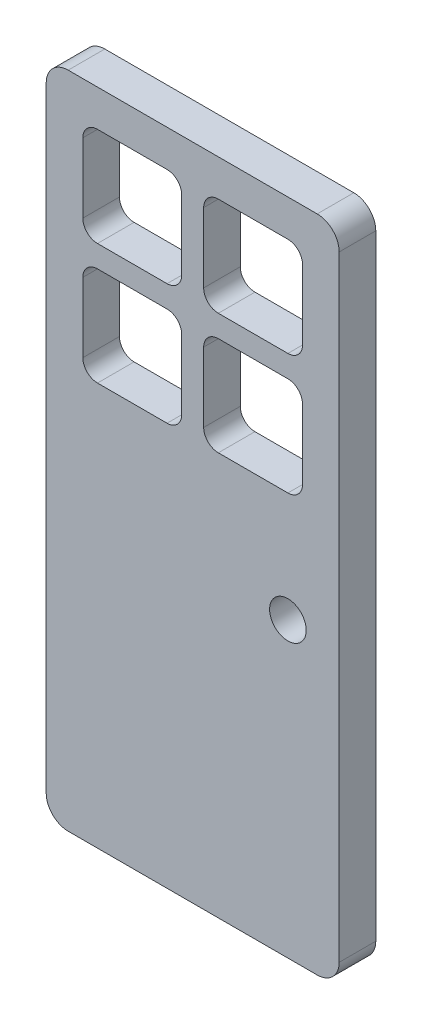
ISO-10303-21;
HEADER;
FILE_DESCRIPTION(('STEP AP214'),'2;1');
FILE_NAME('part.step','',(''),(''),'','','');
FILE_SCHEMA(('AUTOMOTIVE_DESIGN { 1 0 10303 214 1 1 1 1 }'));
ENDSEC;
DATA;
#1=APPLICATION_CONTEXT('core data for automotive mechanical design processes');
#2=APPLICATION_PROTOCOL_DEFINITION('international standard','automotive_design',2000,#1);
#3=PRODUCT_CONTEXT('',#1,'mechanical');
#4=PRODUCT('Part','Part','',(#3));
#5=PRODUCT_RELATED_PRODUCT_CATEGORY('part','',(#4));
#6=PRODUCT_DEFINITION_FORMATION('','',#4);
#7=PRODUCT_DEFINITION_CONTEXT('part definition',#1,'design');
#8=PRODUCT_DEFINITION('design','',#6,#7);
#9=PRODUCT_DEFINITION_SHAPE('','',#8);
#10=(LENGTH_UNIT() NAMED_UNIT(*) SI_UNIT(.MILLI.,.METRE.));
#11=(NAMED_UNIT(*) PLANE_ANGLE_UNIT() SI_UNIT($,.RADIAN.));
#12=(NAMED_UNIT(*) SI_UNIT($,.STERADIAN.) SOLID_ANGLE_UNIT());
#13=UNCERTAINTY_MEASURE_WITH_UNIT(LENGTH_MEASURE(1.E-05),#10,'distance_accuracy_value','');
#14=(GEOMETRIC_REPRESENTATION_CONTEXT(3) GLOBAL_UNCERTAINTY_ASSIGNED_CONTEXT((#13)) GLOBAL_UNIT_ASSIGNED_CONTEXT((#10,
#11,#12)) REPRESENTATION_CONTEXT('',''));
#15=CARTESIAN_POINT('',(0.,0.,0.));
#16=DIRECTION('',(0.,0.,1.));
#17=DIRECTION('',(1.,0.,0.));
#18=AXIS2_PLACEMENT_3D('',#15,#16,#17);
#19=CARTESIAN_POINT('',(-15.,9.99999999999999,-2.5));
#20=DIRECTION('',(-1.,0.,0.));
#21=DIRECTION('',(0.,-1.,0.));
#22=AXIS2_PLACEMENT_3D('',#19,#20,#21);
#23=PLANE('',#22);
#24=DIRECTION('',(0.,-1.,0.));
#25=VECTOR('',#24,1.);
#26=CARTESIAN_POINT('',(-15.,9.99999999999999,2.5));
#27=LINE('',#26,#25);
#28=CARTESIAN_POINT('',(-15.,21.5,2.5));
#29=VERTEX_POINT('',#28);
#30=CARTESIAN_POINT('',(-15.,12.,2.5));
#31=VERTEX_POINT('',#30);
#32=EDGE_CURVE('E510',#29,#31,#27,.T.);
#33=ORIENTED_EDGE('',*,*,#32,.T.);
#34=DIRECTION('',(0.,0.,1.));
#35=VECTOR('',#34,1.);
#36=CARTESIAN_POINT('',(-15.,12.,-2.5));
#37=LINE('',#36,#35);
#38=CARTESIAN_POINT('',(-15.,12.,-2.5));
#39=VERTEX_POINT('',#38);
#40=EDGE_CURVE('E432',#31,#39,#37,.F.);
#41=ORIENTED_EDGE('',*,*,#40,.T.);
#42=DIRECTION('',(0.,-1.,0.));
#43=VECTOR('',#42,1.);
#44=CARTESIAN_POINT('',(-15.,9.99999999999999,-2.5));
#45=LINE('',#44,#43);
#46=CARTESIAN_POINT('',(-15.,21.5,-2.5));
#47=VERTEX_POINT('',#46);
#48=EDGE_CURVE('E562',#47,#39,#45,.T.);
#49=ORIENTED_EDGE('',*,*,#48,.F.);
#50=DIRECTION('',(0.,0.,1.));
#51=VECTOR('',#50,1.);
#52=CARTESIAN_POINT('',(-15.,21.5,2.5));
#53=LINE('',#52,#51);
#54=EDGE_CURVE('E429',#47,#29,#53,.T.);
#55=ORIENTED_EDGE('',*,*,#54,.T.);
#56=EDGE_LOOP('',(#33,#41,#49,#55));
#57=FACE_BOUND('',#56,.T.);
#58=ADVANCED_FACE('F35',(#57),#23,.F.);
#59=CARTESIAN_POINT('',(15.,40.,-2.5));
#60=DIRECTION('',(0.,1.,0.));
#61=DIRECTION('',(0.,0.,1.));
#62=AXIS2_PLACEMENT_3D('',#59,#60,#61);
#63=PLANE('',#62);
#64=DIRECTION('',(-1.,0.,0.));
#65=VECTOR('',#64,1.);
#66=CARTESIAN_POINT('',(15.,40.,-2.5));
#67=LINE('',#66,#65);
#68=CARTESIAN_POINT('',(-3.50000000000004,40.,-2.5));
#69=VERTEX_POINT('',#68);
#70=CARTESIAN_POINT('',(-13.,40.,-2.5));
#71=VERTEX_POINT('',#70);
#72=EDGE_CURVE('E570',#69,#71,#67,.T.);
#73=ORIENTED_EDGE('',*,*,#72,.F.);
#74=DIRECTION('',(0.,0.,1.));
#75=VECTOR('',#74,1.);
#76=CARTESIAN_POINT('',(-3.50000000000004,40.,2.5));
#77=LINE('',#76,#75);
#78=CARTESIAN_POINT('',(-3.50000000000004,40.,2.5));
#79=VERTEX_POINT('',#78);
#80=EDGE_CURVE('E401',#69,#79,#77,.T.);
#81=ORIENTED_EDGE('',*,*,#80,.T.);
#82=DIRECTION('',(-1.,0.,0.));
#83=VECTOR('',#82,1.);
#84=CARTESIAN_POINT('',(15.,40.,2.5));
#85=LINE('',#84,#83);
#86=CARTESIAN_POINT('',(-13.,40.,2.5));
#87=VERTEX_POINT('',#86);
#88=EDGE_CURVE('E579',#79,#87,#85,.T.);
#89=ORIENTED_EDGE('',*,*,#88,.T.);
#90=DIRECTION('',(0.,0.,1.));
#91=VECTOR('',#90,1.);
#92=CARTESIAN_POINT('',(-13.,40.,-2.5));
#93=LINE('',#92,#91);
#94=EDGE_CURVE('E399',#87,#71,#93,.F.);
#95=ORIENTED_EDGE('',*,*,#94,.T.);
#96=EDGE_LOOP('',(#73,#81,#89,#95));
#97=FACE_BOUND('',#96,.T.);
#98=ADVANCED_FACE('F623',(#97),#63,.F.);
#99=CARTESIAN_POINT('',(15.,9.99999999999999,-2.5));
#100=DIRECTION('',(1.,0.,0.));
#101=DIRECTION('',(0.,0.,-1.));
#102=AXIS2_PLACEMENT_3D('',#99,#100,#101);
#103=PLANE('',#102);
#104=DIRECTION('',(0.,1.,0.));
#105=VECTOR('',#104,1.);
#106=CARTESIAN_POINT('',(15.,9.99999999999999,2.5));
#107=LINE('',#106,#105);
#108=CARTESIAN_POINT('',(15.,12.,2.5));
#109=VERTEX_POINT('',#108);
#110=CARTESIAN_POINT('',(15.,21.5,2.5));
#111=VERTEX_POINT('',#110);
#112=EDGE_CURVE('E576',#109,#111,#107,.T.);
#113=ORIENTED_EDGE('',*,*,#112,.T.);
#114=DIRECTION('',(0.,0.,1.));
#115=VECTOR('',#114,1.);
#116=CARTESIAN_POINT('',(15.,21.5,-2.5));
#117=LINE('',#116,#115);
#118=CARTESIAN_POINT('',(15.,21.5,-2.5));
#119=VERTEX_POINT('',#118);
#120=EDGE_CURVE('E382',#111,#119,#117,.F.);
#121=ORIENTED_EDGE('',*,*,#120,.T.);
#122=DIRECTION('',(0.,1.,0.));
#123=VECTOR('',#122,1.);
#124=CARTESIAN_POINT('',(15.,9.99999999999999,-2.5));
#125=LINE('',#124,#123);
#126=CARTESIAN_POINT('',(15.,12.,-2.5));
#127=VERTEX_POINT('',#126);
#128=EDGE_CURVE('E567',#127,#119,#125,.T.);
#129=ORIENTED_EDGE('',*,*,#128,.F.);
#130=DIRECTION('',(0.,0.,1.));
#131=VECTOR('',#130,1.);
#132=CARTESIAN_POINT('',(15.,12.,2.5));
#133=LINE('',#132,#131);
#134=EDGE_CURVE('E379',#127,#109,#133,.T.);
#135=ORIENTED_EDGE('',*,*,#134,.T.);
#136=EDGE_LOOP('',(#113,#121,#129,#135));
#137=FACE_BOUND('',#136,.T.);
#138=ADVANCED_FACE('F629',(#137),#103,.F.);
#139=CARTESIAN_POINT('',(15.,9.99999999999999,-2.5));
#140=DIRECTION('',(0.,-1.,0.));
#141=DIRECTION('',(0.,0.,-1.));
#142=AXIS2_PLACEMENT_3D('',#139,#140,#141);
#143=PLANE('',#142);
#144=DIRECTION('',(1.,0.,0.));
#145=VECTOR('',#144,1.);
#146=CARTESIAN_POINT('',(15.,9.99999999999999,2.5));
#147=LINE('',#146,#145);
#148=CARTESIAN_POINT('',(-13.,9.99999999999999,2.5));
#149=VERTEX_POINT('',#148);
#150=CARTESIAN_POINT('',(-3.50000000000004,9.99999999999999,2.5));
#151=VERTEX_POINT('',#150);
#152=EDGE_CURVE('E572',#149,#151,#147,.T.);
#153=ORIENTED_EDGE('',*,*,#152,.T.);
#154=DIRECTION('',(0.,0.,1.));
#155=VECTOR('',#154,1.);
#156=CARTESIAN_POINT('',(-3.50000000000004,9.99999999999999,-2.5));
#157=LINE('',#156,#155);
#158=CARTESIAN_POINT('',(-3.50000000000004,9.99999999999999,-2.5));
#159=VERTEX_POINT('',#158);
#160=EDGE_CURVE('E427',#151,#159,#157,.F.);
#161=ORIENTED_EDGE('',*,*,#160,.T.);
#162=DIRECTION('',(1.,0.,0.));
#163=VECTOR('',#162,1.);
#164=CARTESIAN_POINT('',(15.,9.99999999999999,-2.5));
#165=LINE('',#164,#163);
#166=CARTESIAN_POINT('',(-13.,9.99999999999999,-2.5));
#167=VERTEX_POINT('',#166);
#168=EDGE_CURVE('E563',#167,#159,#165,.T.);
#169=ORIENTED_EDGE('',*,*,#168,.F.);
#170=DIRECTION('',(0.,0.,1.));
#171=VECTOR('',#170,1.);
#172=CARTESIAN_POINT('',(-13.,9.99999999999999,2.5));
#173=LINE('',#172,#171);
#174=EDGE_CURVE('E424',#167,#149,#173,.T.);
#175=ORIENTED_EDGE('',*,*,#174,.T.);
#176=EDGE_LOOP('',(#153,#161,#169,#175));
#177=FACE_BOUND('',#176,.T.);
#178=ADVANCED_FACE('F755',(#177),#143,.F.);
#179=CARTESIAN_POINT('',(-20.,-45.,2.5));
#180=DIRECTION('',(1.,0.,0.));
#181=DIRECTION('',(0.,0.,-1.));
#182=AXIS2_PLACEMENT_3D('',#179,#180,#181);
#183=PLANE('',#182);
#184=DIRECTION('',(0.,-1.,0.));
#185=VECTOR('',#184,1.);
#186=CARTESIAN_POINT('',(-20.,-45.,-2.5));
#187=LINE('',#186,#185);
#188=CARTESIAN_POINT('',(-20.,42.,-2.5));
#189=VERTEX_POINT('',#188);
#190=CARTESIAN_POINT('',(-20.,-42.,-2.5));
#191=VERTEX_POINT('',#190);
#192=EDGE_CURVE('E320',#189,#191,#187,.T.);
#193=ORIENTED_EDGE('',*,*,#192,.T.);
#194=DIRECTION('',(0.,0.,-1.));
#195=VECTOR('',#194,1.);
#196=CARTESIAN_POINT('',(-20.,-42.,2.5));
#197=LINE('',#196,#195);
#198=CARTESIAN_POINT('',(-20.,-42.,2.5));
#199=VERTEX_POINT('',#198);
#200=EDGE_CURVE('E298',#191,#199,#197,.F.);
#201=ORIENTED_EDGE('',*,*,#200,.T.);
#202=DIRECTION('',(0.,-1.,0.));
#203=VECTOR('',#202,1.);
#204=CARTESIAN_POINT('',(-20.,-45.,2.5));
#205=LINE('',#204,#203);
#206=CARTESIAN_POINT('',(-20.,42.,2.5));
#207=VERTEX_POINT('',#206);
#208=EDGE_CURVE('E331',#207,#199,#205,.T.);
#209=ORIENTED_EDGE('',*,*,#208,.F.);
#210=DIRECTION('',(0.,0.,-1.));
#211=VECTOR('',#210,1.);
#212=CARTESIAN_POINT('',(-20.,42.,2.5));
#213=LINE('',#212,#211);
#214=EDGE_CURVE('E303',#207,#189,#213,.T.);
#215=ORIENTED_EDGE('',*,*,#214,.T.);
#216=EDGE_LOOP('',(#193,#201,#209,#215));
#217=FACE_BOUND('',#216,.T.);
#218=ADVANCED_FACE('F601',(#217),#183,.F.);
#219=CARTESIAN_POINT('',(20.,-45.,2.5));
#220=DIRECTION('',(0.,1.,0.));
#221=DIRECTION('',(-1.,0.,0.));
#222=AXIS2_PLACEMENT_3D('',#219,#220,#221);
#223=PLANE('',#222);
#224=DIRECTION('',(1.,0.,0.));
#225=VECTOR('',#224,1.);
#226=CARTESIAN_POINT('',(20.,-45.,2.5));
#227=LINE('',#226,#225);
#228=CARTESIAN_POINT('',(-17.,-45.,2.5));
#229=VERTEX_POINT('',#228);
#230=CARTESIAN_POINT('',(17.,-45.,2.5));
#231=VERTEX_POINT('',#230);
#232=EDGE_CURVE('E313',#229,#231,#227,.T.);
#233=ORIENTED_EDGE('',*,*,#232,.F.);
#234=DIRECTION('',(0.,0.,-1.));
#235=VECTOR('',#234,1.);
#236=CARTESIAN_POINT('',(-17.,-45.,2.5));
#237=LINE('',#236,#235);
#238=CARTESIAN_POINT('',(-17.,-45.,-2.5));
#239=VERTEX_POINT('',#238);
#240=EDGE_CURVE('E297',#229,#239,#237,.T.);
#241=ORIENTED_EDGE('',*,*,#240,.T.);
#242=DIRECTION('',(1.,0.,0.));
#243=VECTOR('',#242,1.);
#244=CARTESIAN_POINT('',(20.,-45.,-2.5));
#245=LINE('',#244,#243);
#246=CARTESIAN_POINT('',(17.,-45.,-2.5));
#247=VERTEX_POINT('',#246);
#248=EDGE_CURVE('E310',#239,#247,#245,.T.);
#249=ORIENTED_EDGE('',*,*,#248,.T.);
#250=DIRECTION('',(0.,0.,-1.));
#251=VECTOR('',#250,1.);
#252=CARTESIAN_POINT('',(17.,-45.,2.5));
#253=LINE('',#252,#251);
#254=EDGE_CURVE('E315',#247,#231,#253,.F.);
#255=ORIENTED_EDGE('',*,*,#254,.T.);
#256=EDGE_LOOP('',(#233,#241,#249,#255));
#257=FACE_BOUND('',#256,.T.);
#258=ADVANCED_FACE('F309',(#257),#223,.F.);
#259=CARTESIAN_POINT('',(20.,-45.,2.5));
#260=DIRECTION('',(-1.,0.,0.));
#261=DIRECTION('',(0.,0.,1.));
#262=AXIS2_PLACEMENT_3D('',#259,#260,#261);
#263=PLANE('',#262);
#264=DIRECTION('',(0.,1.,0.));
#265=VECTOR('',#264,1.);
#266=CARTESIAN_POINT('',(20.,-45.,2.5));
#267=LINE('',#266,#265);
#268=CARTESIAN_POINT('',(20.,-42.,2.5));
#269=VERTEX_POINT('',#268);
#270=CARTESIAN_POINT('',(20.,42.,2.5));
#271=VERTEX_POINT('',#270);
#272=EDGE_CURVE('E586',#269,#271,#267,.T.);
#273=ORIENTED_EDGE('',*,*,#272,.F.);
#274=DIRECTION('',(0.,0.,-1.));
#275=VECTOR('',#274,1.);
#276=CARTESIAN_POINT('',(20.,-42.,2.5));
#277=LINE('',#276,#275);
#278=CARTESIAN_POINT('',(20.,-42.,-2.5));
#279=VERTEX_POINT('',#278);
#280=EDGE_CURVE('E351',#269,#279,#277,.T.);
#281=ORIENTED_EDGE('',*,*,#280,.T.);
#282=DIRECTION('',(0.,1.,0.));
#283=VECTOR('',#282,1.);
#284=CARTESIAN_POINT('',(20.,-45.,-2.5));
#285=LINE('',#284,#283);
#286=CARTESIAN_POINT('',(20.,42.,-2.5));
#287=VERTEX_POINT('',#286);
#288=EDGE_CURVE('E319',#279,#287,#285,.T.);
#289=ORIENTED_EDGE('',*,*,#288,.T.);
#290=DIRECTION('',(0.,0.,-1.));
#291=VECTOR('',#290,1.);
#292=CARTESIAN_POINT('',(20.,42.,2.5));
#293=LINE('',#292,#291);
#294=EDGE_CURVE('E349',#287,#271,#293,.F.);
#295=ORIENTED_EDGE('',*,*,#294,.T.);
#296=EDGE_LOOP('',(#273,#281,#289,#295));
#297=FACE_BOUND('',#296,.T.);
#298=ADVANCED_FACE('F609',(#297),#263,.F.);
#299=CARTESIAN_POINT('',(20.,45.,2.5));
#300=DIRECTION('',(0.,-1.,0.));
#301=DIRECTION('',(0.,0.,-1.));
#302=AXIS2_PLACEMENT_3D('',#299,#300,#301);
#303=PLANE('',#302);
#304=DIRECTION('',(-1.,0.,0.));
#305=VECTOR('',#304,1.);
#306=CARTESIAN_POINT('',(20.,45.,2.5));
#307=LINE('',#306,#305);
#308=CARTESIAN_POINT('',(17.,45.,2.5));
#309=VERTEX_POINT('',#308);
#310=CARTESIAN_POINT('',(-17.,45.,2.5));
#311=VERTEX_POINT('',#310);
#312=EDGE_CURVE('E332',#309,#311,#307,.T.);
#313=ORIENTED_EDGE('',*,*,#312,.F.);
#314=DIRECTION('',(0.,0.,-1.));
#315=VECTOR('',#314,1.);
#316=CARTESIAN_POINT('',(17.,45.,2.5));
#317=LINE('',#316,#315);
#318=CARTESIAN_POINT('',(17.,45.,-2.5));
#319=VERTEX_POINT('',#318);
#320=EDGE_CURVE('E356',#309,#319,#317,.T.);
#321=ORIENTED_EDGE('',*,*,#320,.T.);
#322=DIRECTION('',(-1.,0.,0.));
#323=VECTOR('',#322,1.);
#324=CARTESIAN_POINT('',(20.,45.,-2.5));
#325=LINE('',#324,#323);
#326=CARTESIAN_POINT('',(-17.,45.,-2.5));
#327=VERTEX_POINT('',#326);
#328=EDGE_CURVE('E323',#319,#327,#325,.T.);
#329=ORIENTED_EDGE('',*,*,#328,.T.);
#330=DIRECTION('',(0.,0.,-1.));
#331=VECTOR('',#330,1.);
#332=CARTESIAN_POINT('',(-17.,45.,2.5));
#333=LINE('',#332,#331);
#334=EDGE_CURVE('E354',#327,#311,#333,.F.);
#335=ORIENTED_EDGE('',*,*,#334,.T.);
#336=EDGE_LOOP('',(#313,#321,#329,#335));
#337=FACE_BOUND('',#336,.T.);
#338=ADVANCED_FACE('F603',(#337),#303,.F.);
#339=CARTESIAN_POINT('',(0.,0.,2.5));
#340=DIRECTION('',(0.,0.,1.));
#341=DIRECTION('',(1.,0.,0.));
#342=AXIS2_PLACEMENT_3D('',#339,#340,#341);
#343=PLANE('',#342);
#344=CARTESIAN_POINT('',(13.,-5.,2.5));
#345=DIRECTION('',(0.,0.,1.));
#346=DIRECTION('',(1.,0.,0.));
#347=AXIS2_PLACEMENT_3D('',#344,#345,#346);
#348=CIRCLE('',#347,2.5);
#349=CARTESIAN_POINT('',(15.5,-5.,2.5));
#350=VERTEX_POINT('',#349);
#351=EDGE_CURVE('E813',#350,#350,#348,.T.);
#352=ORIENTED_EDGE('',*,*,#351,.F.);
#353=EDGE_LOOP('',(#352));
#354=FACE_BOUND('',#353,.T.);
#355=DIRECTION('',(0.,1.,0.));
#356=VECTOR('',#355,1.);
#357=CARTESIAN_POINT('',(-1.50000000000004,0.,2.5));
#358=LINE('',#357,#356);
#359=CARTESIAN_POINT('',(-1.50000000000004,28.5,2.5));
#360=VERTEX_POINT('',#359);
#361=CARTESIAN_POINT('',(-1.50000000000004,38.,2.5));
#362=VERTEX_POINT('',#361);
#363=EDGE_CURVE('E552',#360,#362,#358,.T.);
#364=ORIENTED_EDGE('',*,*,#363,.F.);
#365=CARTESIAN_POINT('',(-3.50000000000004,28.5,2.5));
#366=DIRECTION('',(0.,0.,1.));
#367=DIRECTION('',(1.,0.,0.));
#368=AXIS2_PLACEMENT_3D('',#365,#366,#367);
#369=CIRCLE('',#368,2.);
#370=CARTESIAN_POINT('',(-3.50000000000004,26.5,2.5));
#371=VERTEX_POINT('',#370);
#372=EDGE_CURVE('E478',#360,#371,#369,.F.);
#373=ORIENTED_EDGE('',*,*,#372,.T.);
#374=DIRECTION('',(-1.,0.,0.));
#375=VECTOR('',#374,1.);
#376=CARTESIAN_POINT('',(0.,26.5,2.5));
#377=LINE('',#376,#375);
#378=CARTESIAN_POINT('',(-13.,26.5,2.5));
#379=VERTEX_POINT('',#378);
#380=EDGE_CURVE('E504',#371,#379,#377,.T.);
#381=ORIENTED_EDGE('',*,*,#380,.T.);
#382=CARTESIAN_POINT('',(-13.,28.5,2.5));
#383=DIRECTION('',(0.,0.,1.));
#384=DIRECTION('',(1.,0.,0.));
#385=AXIS2_PLACEMENT_3D('',#382,#383,#384);
#386=CIRCLE('',#385,2.);
#387=CARTESIAN_POINT('',(-15.,28.5,2.5));
#388=VERTEX_POINT('',#387);
#389=EDGE_CURVE('E43',#379,#388,#386,.F.);
#390=ORIENTED_EDGE('',*,*,#389,.T.);
#391=CARTESIAN_POINT('',(-15.,38.,2.5));
#392=VERTEX_POINT('',#391);
#393=EDGE_CURVE('E502',#392,#388,#27,.T.);
#394=ORIENTED_EDGE('',*,*,#393,.F.);
#395=CARTESIAN_POINT('',(-13.,38.,2.5));
#396=DIRECTION('',(0.,0.,1.));
#397=DIRECTION('',(1.,0.,0.));
#398=AXIS2_PLACEMENT_3D('',#395,#396,#397);
#399=CIRCLE('',#398,2.);
#400=EDGE_CURVE('E494',#392,#87,#399,.F.);
#401=ORIENTED_EDGE('',*,*,#400,.T.);
#402=ORIENTED_EDGE('',*,*,#88,.F.);
#403=CARTESIAN_POINT('',(-3.50000000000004,38.,2.5));
#404=DIRECTION('',(0.,0.,1.));
#405=DIRECTION('',(1.,0.,0.));
#406=AXIS2_PLACEMENT_3D('',#403,#404,#405);
#407=CIRCLE('',#406,2.);
#408=EDGE_CURVE('E470',#79,#362,#407,.F.);
#409=ORIENTED_EDGE('',*,*,#408,.T.);
#410=EDGE_LOOP('',(#364,#373,#381,#390,#394,#401,#402,#409));
#411=FACE_BOUND('',#410,.T.);
#412=DIRECTION('',(-1.,0.,0.));
#413=VECTOR('',#412,1.);
#414=CARTESIAN_POINT('',(0.,26.5,2.5));
#415=LINE('',#414,#413);
#416=CARTESIAN_POINT('',(13.,26.5,2.5));
#417=VERTEX_POINT('',#416);
#418=CARTESIAN_POINT('',(3.49999999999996,26.5,2.5));
#419=VERTEX_POINT('',#418);
#420=EDGE_CURVE('E546',#417,#419,#415,.T.);
#421=ORIENTED_EDGE('',*,*,#420,.T.);
#422=CARTESIAN_POINT('',(3.49999999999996,28.5,2.5));
#423=DIRECTION('',(0.,0.,1.));
#424=DIRECTION('',(1.,0.,0.));
#425=AXIS2_PLACEMENT_3D('',#422,#423,#424);
#426=CIRCLE('',#425,2.);
#427=CARTESIAN_POINT('',(1.49999999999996,28.5,2.5));
#428=VERTEX_POINT('',#427);
#429=EDGE_CURVE('E462',#419,#428,#426,.F.);
#430=ORIENTED_EDGE('',*,*,#429,.T.);
#431=DIRECTION('',(0.,1.,0.));
#432=VECTOR('',#431,1.);
#433=CARTESIAN_POINT('',(1.49999999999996,0.,2.5));
#434=LINE('',#433,#432);
#435=CARTESIAN_POINT('',(1.49999999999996,38.,2.5));
#436=VERTEX_POINT('',#435);
#437=EDGE_CURVE('E549',#428,#436,#434,.T.);
#438=ORIENTED_EDGE('',*,*,#437,.T.);
#439=CARTESIAN_POINT('',(3.49999999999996,38.,2.5));
#440=DIRECTION('',(0.,0.,1.));
#441=DIRECTION('',(1.,0.,0.));
#442=AXIS2_PLACEMENT_3D('',#439,#440,#441);
#443=CIRCLE('',#442,2.);
#444=CARTESIAN_POINT('',(3.49999999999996,40.,2.5));
#445=VERTEX_POINT('',#444);
#446=EDGE_CURVE('E466',#436,#445,#443,.F.);
#447=ORIENTED_EDGE('',*,*,#446,.T.);
#448=CARTESIAN_POINT('',(13.,40.,2.5));
#449=VERTEX_POINT('',#448);
#450=EDGE_CURVE('E582',#449,#445,#85,.T.);
#451=ORIENTED_EDGE('',*,*,#450,.F.);
#452=CARTESIAN_POINT('',(13.,38.,2.5));
#453=DIRECTION('',(0.,0.,1.));
#454=DIRECTION('',(1.,0.,0.));
#455=AXIS2_PLACEMENT_3D('',#452,#453,#454);
#456=CIRCLE('',#455,2.);
#457=CARTESIAN_POINT('',(15.,38.,2.5));
#458=VERTEX_POINT('',#457);
#459=EDGE_CURVE('E438',#449,#458,#456,.F.);
#460=ORIENTED_EDGE('',*,*,#459,.T.);
#461=CARTESIAN_POINT('',(15.,28.5,2.5));
#462=VERTEX_POINT('',#461);
#463=EDGE_CURVE('E575',#462,#458,#107,.T.);
#464=ORIENTED_EDGE('',*,*,#463,.F.);
#465=CARTESIAN_POINT('',(13.,28.5,2.5));
#466=DIRECTION('',(0.,0.,1.));
#467=DIRECTION('',(1.,0.,0.));
#468=AXIS2_PLACEMENT_3D('',#465,#466,#467);
#469=CIRCLE('',#468,2.);
#470=EDGE_CURVE('E442',#462,#417,#469,.F.);
#471=ORIENTED_EDGE('',*,*,#470,.T.);
#472=EDGE_LOOP('',(#421,#430,#438,#447,#451,#460,#464,#471));
#473=FACE_BOUND('',#472,.T.);
#474=DIRECTION('',(-1.,0.,0.));
#475=VECTOR('',#474,1.);
#476=CARTESIAN_POINT('',(0.,23.5,2.5));
#477=LINE('',#476,#475);
#478=CARTESIAN_POINT('',(13.,23.5,2.5));
#479=VERTEX_POINT('',#478);
#480=CARTESIAN_POINT('',(3.49999999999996,23.5,2.5));
#481=VERTEX_POINT('',#480);
#482=EDGE_CURVE('E543',#479,#481,#477,.T.);
#483=ORIENTED_EDGE('',*,*,#482,.F.);
#484=CARTESIAN_POINT('',(13.,21.5,2.5));
#485=DIRECTION('',(0.,0.,1.));
#486=DIRECTION('',(1.,0.,0.));
#487=AXIS2_PLACEMENT_3D('',#484,#485,#486);
#488=CIRCLE('',#487,2.);
#489=EDGE_CURVE('E446',#479,#111,#488,.F.);
#490=ORIENTED_EDGE('',*,*,#489,.T.);
#491=ORIENTED_EDGE('',*,*,#112,.F.);
#492=CARTESIAN_POINT('',(13.,12.,2.5));
#493=DIRECTION('',(0.,0.,1.));
#494=DIRECTION('',(1.,0.,0.));
#495=AXIS2_PLACEMENT_3D('',#492,#493,#494);
#496=CIRCLE('',#495,2.);
#497=CARTESIAN_POINT('',(13.,9.99999999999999,2.5));
#498=VERTEX_POINT('',#497);
#499=EDGE_CURVE('E450',#109,#498,#496,.F.);
#500=ORIENTED_EDGE('',*,*,#499,.T.);
#501=CARTESIAN_POINT('',(3.49999999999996,9.99999999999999,2.5));
#502=VERTEX_POINT('',#501);
#503=EDGE_CURVE('E509',#502,#498,#147,.T.);
#504=ORIENTED_EDGE('',*,*,#503,.F.);
#505=CARTESIAN_POINT('',(3.49999999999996,12.,2.5));
#506=DIRECTION('',(0.,0.,1.));
#507=DIRECTION('',(1.,0.,0.));
#508=AXIS2_PLACEMENT_3D('',#505,#506,#507);
#509=CIRCLE('',#508,2.);
#510=CARTESIAN_POINT('',(1.49999999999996,12.,2.5));
#511=VERTEX_POINT('',#510);
#512=EDGE_CURVE('E454',#502,#511,#509,.F.);
#513=ORIENTED_EDGE('',*,*,#512,.T.);
#514=DIRECTION('',(0.,1.,0.));
#515=VECTOR('',#514,1.);
#516=CARTESIAN_POINT('',(1.49999999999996,0.,2.5));
#517=LINE('',#516,#515);
#518=CARTESIAN_POINT('',(1.49999999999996,21.5,2.5));
#519=VERTEX_POINT('',#518);
#520=EDGE_CURVE('E540',#511,#519,#517,.T.);
#521=ORIENTED_EDGE('',*,*,#520,.T.);
#522=CARTESIAN_POINT('',(3.49999999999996,21.5,2.5));
#523=DIRECTION('',(0.,0.,1.));
#524=DIRECTION('',(1.,0.,0.));
#525=AXIS2_PLACEMENT_3D('',#522,#523,#524);
#526=CIRCLE('',#525,2.);
#527=EDGE_CURVE('E458',#519,#481,#526,.F.);
#528=ORIENTED_EDGE('',*,*,#527,.T.);
#529=EDGE_LOOP('',(#483,#490,#491,#500,#504,#513,#521,#528));
#530=FACE_BOUND('',#529,.T.);
#531=ORIENTED_EDGE('',*,*,#32,.F.);
#532=CARTESIAN_POINT('',(-13.,21.5,2.5));
#533=DIRECTION('',(0.,0.,1.));
#534=DIRECTION('',(1.,0.,0.));
#535=AXIS2_PLACEMENT_3D('',#532,#533,#534);
#536=CIRCLE('',#535,2.);
#537=CARTESIAN_POINT('',(-13.,23.5,2.5));
#538=VERTEX_POINT('',#537);
#539=EDGE_CURVE('E490',#29,#538,#536,.F.);
#540=ORIENTED_EDGE('',*,*,#539,.T.);
#541=DIRECTION('',(-1.,0.,0.));
#542=VECTOR('',#541,1.);
#543=CARTESIAN_POINT('',(0.,23.5,2.5));
#544=LINE('',#543,#542);
#545=CARTESIAN_POINT('',(-3.50000000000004,23.5,2.5));
#546=VERTEX_POINT('',#545);
#547=EDGE_CURVE('E533',#546,#538,#544,.T.);
#548=ORIENTED_EDGE('',*,*,#547,.F.);
#549=CARTESIAN_POINT('',(-3.50000000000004,21.5,2.5));
#550=DIRECTION('',(0.,0.,1.));
#551=DIRECTION('',(1.,0.,0.));
#552=AXIS2_PLACEMENT_3D('',#549,#550,#551);
#553=CIRCLE('',#552,2.);
#554=CARTESIAN_POINT('',(-1.50000000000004,21.5,2.5));
#555=VERTEX_POINT('',#554);
#556=EDGE_CURVE('E474',#546,#555,#553,.F.);
#557=ORIENTED_EDGE('',*,*,#556,.T.);
#558=DIRECTION('',(0.,1.,0.));
#559=VECTOR('',#558,1.);
#560=CARTESIAN_POINT('',(-1.50000000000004,0.,2.5));
#561=LINE('',#560,#559);
#562=CARTESIAN_POINT('',(-1.50000000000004,12.,2.5));
#563=VERTEX_POINT('',#562);
#564=EDGE_CURVE('E536',#563,#555,#561,.T.);
#565=ORIENTED_EDGE('',*,*,#564,.F.);
#566=CARTESIAN_POINT('',(-3.50000000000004,12.,2.5));
#567=DIRECTION('',(0.,0.,1.));
#568=DIRECTION('',(1.,0.,0.));
#569=AXIS2_PLACEMENT_3D('',#566,#567,#568);
#570=CIRCLE('',#569,2.);
#571=EDGE_CURVE('E482',#563,#151,#570,.F.);
#572=ORIENTED_EDGE('',*,*,#571,.T.);
#573=ORIENTED_EDGE('',*,*,#152,.F.);
#574=CARTESIAN_POINT('',(-13.,12.,2.5));
#575=DIRECTION('',(0.,0.,1.));
#576=DIRECTION('',(1.,0.,0.));
#577=AXIS2_PLACEMENT_3D('',#574,#575,#576);
#578=CIRCLE('',#577,2.);
#579=EDGE_CURVE('E486',#149,#31,#578,.F.);
#580=ORIENTED_EDGE('',*,*,#579,.T.);
#581=EDGE_LOOP('',(#531,#540,#548,#557,#565,#572,#573,#580));
#582=FACE_BOUND('',#581,.T.);
#583=ORIENTED_EDGE('',*,*,#208,.T.);
#584=CARTESIAN_POINT('',(-17.,-42.,2.5));
#585=DIRECTION('',(0.,0.,1.));
#586=DIRECTION('',(1.,0.,0.));
#587=AXIS2_PLACEMENT_3D('',#584,#585,#586);
#588=CIRCLE('',#587,3.);
#589=EDGE_CURVE('E347',#199,#229,#588,.T.);
#590=ORIENTED_EDGE('',*,*,#589,.T.);
#591=ORIENTED_EDGE('',*,*,#232,.T.);
#592=CARTESIAN_POINT('',(17.,-42.,2.5));
#593=DIRECTION('',(0.,0.,1.));
#594=DIRECTION('',(1.,0.,0.));
#595=AXIS2_PLACEMENT_3D('',#592,#593,#594);
#596=CIRCLE('',#595,3.);
#597=EDGE_CURVE('E345',#231,#269,#596,.T.);
#598=ORIENTED_EDGE('',*,*,#597,.T.);
#599=ORIENTED_EDGE('',*,*,#272,.T.);
#600=CARTESIAN_POINT('',(17.,42.,2.5));
#601=DIRECTION('',(0.,0.,1.));
#602=DIRECTION('',(1.,0.,0.));
#603=AXIS2_PLACEMENT_3D('',#600,#601,#602);
#604=CIRCLE('',#603,3.);
#605=EDGE_CURVE('E343',#271,#309,#604,.T.);
#606=ORIENTED_EDGE('',*,*,#605,.T.);
#607=ORIENTED_EDGE('',*,*,#312,.T.);
#608=CARTESIAN_POINT('',(-17.,42.,2.5));
#609=DIRECTION('',(0.,0.,1.));
#610=DIRECTION('',(1.,0.,0.));
#611=AXIS2_PLACEMENT_3D('',#608,#609,#610);
#612=CIRCLE('',#611,3.);
#613=EDGE_CURVE('E341',#311,#207,#612,.T.);
#614=ORIENTED_EDGE('',*,*,#613,.T.);
#615=EDGE_LOOP('',(#583,#590,#591,#598,#599,#606,#607,#614));
#616=FACE_BOUND('',#615,.T.);
#617=ADVANCED_FACE('F500',(#354,#411,#473,#530,#582,#616),#343,.T.);
#618=CARTESIAN_POINT('',(0.,0.,-2.5));
#619=DIRECTION('',(0.,0.,1.));
#620=DIRECTION('',(1.,0.,0.));
#621=AXIS2_PLACEMENT_3D('',#618,#619,#620);
#622=PLANE('',#621);
#623=CARTESIAN_POINT('',(13.,-5.,-2.5));
#624=DIRECTION('',(0.,0.,1.));
#625=DIRECTION('',(1.,0.,0.));
#626=AXIS2_PLACEMENT_3D('',#623,#624,#625);
#627=CIRCLE('',#626,2.5);
#628=CARTESIAN_POINT('',(15.5,-5.,-2.5));
#629=VERTEX_POINT('',#628);
#630=EDGE_CURVE('E537',#629,#629,#627,.T.);
#631=ORIENTED_EDGE('',*,*,#630,.T.);
#632=EDGE_LOOP('',(#631));
#633=FACE_BOUND('',#632,.T.);
#634=DIRECTION('',(1.,0.,0.));
#635=VECTOR('',#634,1.);
#636=CARTESIAN_POINT('',(0.,23.5,-2.5));
#637=LINE('',#636,#635);
#638=CARTESIAN_POINT('',(-13.,23.5,-2.5));
#639=VERTEX_POINT('',#638);
#640=CARTESIAN_POINT('',(-3.50000000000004,23.5,-2.5));
#641=VERTEX_POINT('',#640);
#642=EDGE_CURVE('E523',#639,#641,#637,.T.);
#643=ORIENTED_EDGE('',*,*,#642,.F.);
#644=CARTESIAN_POINT('',(-13.,21.5,-2.5));
#645=DIRECTION('',(0.,0.,1.));
#646=DIRECTION('',(1.,0.,0.));
#647=AXIS2_PLACEMENT_3D('',#644,#645,#646);
#648=CIRCLE('',#647,2.);
#649=EDGE_CURVE('E492',#639,#47,#648,.T.);
#650=ORIENTED_EDGE('',*,*,#649,.T.);
#651=ORIENTED_EDGE('',*,*,#48,.T.);
#652=CARTESIAN_POINT('',(-13.,12.,-2.5));
#653=DIRECTION('',(0.,0.,1.));
#654=DIRECTION('',(1.,0.,0.));
#655=AXIS2_PLACEMENT_3D('',#652,#653,#654);
#656=CIRCLE('',#655,2.);
#657=EDGE_CURVE('E488',#39,#167,#656,.T.);
#658=ORIENTED_EDGE('',*,*,#657,.T.);
#659=ORIENTED_EDGE('',*,*,#168,.T.);
#660=CARTESIAN_POINT('',(-3.50000000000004,12.,-2.5));
#661=DIRECTION('',(0.,0.,1.));
#662=DIRECTION('',(1.,0.,0.));
#663=AXIS2_PLACEMENT_3D('',#660,#661,#662);
#664=CIRCLE('',#663,2.);
#665=CARTESIAN_POINT('',(-1.50000000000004,12.,-2.5));
#666=VERTEX_POINT('',#665);
#667=EDGE_CURVE('E484',#159,#666,#664,.T.);
#668=ORIENTED_EDGE('',*,*,#667,.T.);
#669=DIRECTION('',(0.,-1.,0.));
#670=VECTOR('',#669,1.);
#671=CARTESIAN_POINT('',(-1.50000000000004,0.,-2.5));
#672=LINE('',#671,#670);
#673=CARTESIAN_POINT('',(-1.50000000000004,21.5,-2.5));
#674=VERTEX_POINT('',#673);
#675=EDGE_CURVE('E556',#674,#666,#672,.T.);
#676=ORIENTED_EDGE('',*,*,#675,.F.);
#677=CARTESIAN_POINT('',(-3.50000000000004,21.5,-2.5));
#678=DIRECTION('',(0.,0.,1.));
#679=DIRECTION('',(1.,0.,0.));
#680=AXIS2_PLACEMENT_3D('',#677,#678,#679);
#681=CIRCLE('',#680,2.);
#682=EDGE_CURVE('E476',#674,#641,#681,.T.);
#683=ORIENTED_EDGE('',*,*,#682,.T.);
#684=EDGE_LOOP('',(#643,#650,#651,#658,#659,#668,#676,#683));
#685=FACE_BOUND('',#684,.T.);
#686=DIRECTION('',(0.,-1.,0.));
#687=VECTOR('',#686,1.);
#688=CARTESIAN_POINT('',(-1.50000000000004,0.,-2.5));
#689=LINE('',#688,#687);
#690=CARTESIAN_POINT('',(-1.50000000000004,38.,-2.5));
#691=VERTEX_POINT('',#690);
#692=CARTESIAN_POINT('',(-1.50000000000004,28.5,-2.5));
#693=VERTEX_POINT('',#692);
#694=EDGE_CURVE('E524',#691,#693,#689,.T.);
#695=ORIENTED_EDGE('',*,*,#694,.F.);
#696=CARTESIAN_POINT('',(-3.50000000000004,38.,-2.5));
#697=DIRECTION('',(0.,0.,1.));
#698=DIRECTION('',(1.,0.,0.));
#699=AXIS2_PLACEMENT_3D('',#696,#697,#698);
#700=CIRCLE('',#699,2.);
#701=EDGE_CURVE('E472',#691,#69,#700,.T.);
#702=ORIENTED_EDGE('',*,*,#701,.T.);
#703=ORIENTED_EDGE('',*,*,#72,.T.);
#704=CARTESIAN_POINT('',(-13.,38.,-2.5));
#705=DIRECTION('',(0.,0.,1.));
#706=DIRECTION('',(1.,0.,0.));
#707=AXIS2_PLACEMENT_3D('',#704,#705,#706);
#708=CIRCLE('',#707,2.);
#709=CARTESIAN_POINT('',(-15.,38.,-2.5));
#710=VERTEX_POINT('',#709);
#711=EDGE_CURVE('E57',#71,#710,#708,.T.);
#712=ORIENTED_EDGE('',*,*,#711,.T.);
#713=CARTESIAN_POINT('',(-15.,28.5,-2.5));
#714=VERTEX_POINT('',#713);
#715=EDGE_CURVE('E519',#710,#714,#45,.T.);
#716=ORIENTED_EDGE('',*,*,#715,.T.);
#717=CARTESIAN_POINT('',(-13.,28.5,-2.5));
#718=DIRECTION('',(0.,0.,1.));
#719=DIRECTION('',(1.,0.,0.));
#720=AXIS2_PLACEMENT_3D('',#717,#718,#719);
#721=CIRCLE('',#720,2.);
#722=CARTESIAN_POINT('',(-13.,26.5,-2.5));
#723=VERTEX_POINT('',#722);
#724=EDGE_CURVE('E11',#714,#723,#721,.T.);
#725=ORIENTED_EDGE('',*,*,#724,.T.);
#726=DIRECTION('',(1.,0.,0.));
#727=VECTOR('',#726,1.);
#728=CARTESIAN_POINT('',(0.,26.5,-2.5));
#729=LINE('',#728,#727);
#730=CARTESIAN_POINT('',(-3.50000000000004,26.5,-2.5));
#731=VERTEX_POINT('',#730);
#732=EDGE_CURVE('E517',#723,#731,#729,.T.);
#733=ORIENTED_EDGE('',*,*,#732,.T.);
#734=CARTESIAN_POINT('',(-3.50000000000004,28.5,-2.5));
#735=DIRECTION('',(0.,0.,1.));
#736=DIRECTION('',(1.,0.,0.));
#737=AXIS2_PLACEMENT_3D('',#734,#735,#736);
#738=CIRCLE('',#737,2.);
#739=EDGE_CURVE('E480',#731,#693,#738,.T.);
#740=ORIENTED_EDGE('',*,*,#739,.T.);
#741=EDGE_LOOP('',(#695,#702,#703,#712,#716,#725,#733,#740));
#742=FACE_BOUND('',#741,.T.);
#743=DIRECTION('',(0.,-1.,0.));
#744=VECTOR('',#743,1.);
#745=CARTESIAN_POINT('',(1.49999999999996,0.,-2.5));
#746=LINE('',#745,#744);
#747=CARTESIAN_POINT('',(1.49999999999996,38.,-2.5));
#748=VERTEX_POINT('',#747);
#749=CARTESIAN_POINT('',(1.49999999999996,28.5,-2.5));
#750=VERTEX_POINT('',#749);
#751=EDGE_CURVE('E529',#748,#750,#746,.T.);
#752=ORIENTED_EDGE('',*,*,#751,.T.);
#753=CARTESIAN_POINT('',(3.49999999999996,28.5,-2.5));
#754=DIRECTION('',(0.,0.,1.));
#755=DIRECTION('',(1.,0.,0.));
#756=AXIS2_PLACEMENT_3D('',#753,#754,#755);
#757=CIRCLE('',#756,2.);
#758=CARTESIAN_POINT('',(3.49999999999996,26.5,-2.5));
#759=VERTEX_POINT('',#758);
#760=EDGE_CURVE('E464',#750,#759,#757,.T.);
#761=ORIENTED_EDGE('',*,*,#760,.T.);
#762=DIRECTION('',(1.,0.,0.));
#763=VECTOR('',#762,1.);
#764=CARTESIAN_POINT('',(0.,26.5,-2.5));
#765=LINE('',#764,#763);
#766=CARTESIAN_POINT('',(13.,26.5,-2.5));
#767=VERTEX_POINT('',#766);
#768=EDGE_CURVE('E804',#759,#767,#765,.T.);
#769=ORIENTED_EDGE('',*,*,#768,.T.);
#770=CARTESIAN_POINT('',(13.,28.5,-2.5));
#771=DIRECTION('',(0.,0.,1.));
#772=DIRECTION('',(1.,0.,0.));
#773=AXIS2_PLACEMENT_3D('',#770,#771,#772);
#774=CIRCLE('',#773,2.);
#775=CARTESIAN_POINT('',(15.,28.5,-2.5));
#776=VERTEX_POINT('',#775);
#777=EDGE_CURVE('E444',#767,#776,#774,.T.);
#778=ORIENTED_EDGE('',*,*,#777,.T.);
#779=CARTESIAN_POINT('',(15.,38.,-2.5));
#780=VERTEX_POINT('',#779);
#781=EDGE_CURVE('E566',#776,#780,#125,.T.);
#782=ORIENTED_EDGE('',*,*,#781,.T.);
#783=CARTESIAN_POINT('',(13.,38.,-2.5));
#784=DIRECTION('',(0.,0.,1.));
#785=DIRECTION('',(1.,0.,0.));
#786=AXIS2_PLACEMENT_3D('',#783,#784,#785);
#787=CIRCLE('',#786,2.);
#788=CARTESIAN_POINT('',(13.,40.,-2.5));
#789=VERTEX_POINT('',#788);
#790=EDGE_CURVE('E440',#780,#789,#787,.T.);
#791=ORIENTED_EDGE('',*,*,#790,.T.);
#792=CARTESIAN_POINT('',(3.49999999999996,40.,-2.5));
#793=VERTEX_POINT('',#792);
#794=EDGE_CURVE('E325',#789,#793,#67,.T.);
#795=ORIENTED_EDGE('',*,*,#794,.T.);
#796=CARTESIAN_POINT('',(3.49999999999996,38.,-2.5));
#797=DIRECTION('',(0.,0.,1.));
#798=DIRECTION('',(1.,0.,0.));
#799=AXIS2_PLACEMENT_3D('',#796,#797,#798);
#800=CIRCLE('',#799,2.);
#801=EDGE_CURVE('E468',#793,#748,#800,.T.);
#802=ORIENTED_EDGE('',*,*,#801,.T.);
#803=EDGE_LOOP('',(#752,#761,#769,#778,#782,#791,#795,#802));
#804=FACE_BOUND('',#803,.T.);
#805=CARTESIAN_POINT('',(3.49999999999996,9.99999999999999,-2.5));
#806=VERTEX_POINT('',#805);
#807=CARTESIAN_POINT('',(13.,9.99999999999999,-2.5));
#808=VERTEX_POINT('',#807);
#809=EDGE_CURVE('E561',#806,#808,#165,.T.);
#810=ORIENTED_EDGE('',*,*,#809,.T.);
#811=CARTESIAN_POINT('',(13.,12.,-2.5));
#812=DIRECTION('',(0.,0.,1.));
#813=DIRECTION('',(1.,0.,0.));
#814=AXIS2_PLACEMENT_3D('',#811,#812,#813);
#815=CIRCLE('',#814,2.);
#816=EDGE_CURVE('E452',#808,#127,#815,.T.);
#817=ORIENTED_EDGE('',*,*,#816,.T.);
#818=ORIENTED_EDGE('',*,*,#128,.T.);
#819=CARTESIAN_POINT('',(13.,21.5,-2.5));
#820=DIRECTION('',(0.,0.,1.));
#821=DIRECTION('',(1.,0.,0.));
#822=AXIS2_PLACEMENT_3D('',#819,#820,#821);
#823=CIRCLE('',#822,2.);
#824=CARTESIAN_POINT('',(13.,23.5,-2.5));
#825=VERTEX_POINT('',#824);
#826=EDGE_CURVE('E448',#119,#825,#823,.T.);
#827=ORIENTED_EDGE('',*,*,#826,.T.);
#828=DIRECTION('',(1.,0.,0.));
#829=VECTOR('',#828,1.);
#830=CARTESIAN_POINT('',(0.,23.5,-2.5));
#831=LINE('',#830,#829);
#832=CARTESIAN_POINT('',(3.49999999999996,23.5,-2.5));
#833=VERTEX_POINT('',#832);
#834=EDGE_CURVE('E806',#833,#825,#831,.T.);
#835=ORIENTED_EDGE('',*,*,#834,.F.);
#836=CARTESIAN_POINT('',(3.49999999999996,21.5,-2.5));
#837=DIRECTION('',(0.,0.,1.));
#838=DIRECTION('',(1.,0.,0.));
#839=AXIS2_PLACEMENT_3D('',#836,#837,#838);
#840=CIRCLE('',#839,2.);
#841=CARTESIAN_POINT('',(1.49999999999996,21.5,-2.5));
#842=VERTEX_POINT('',#841);
#843=EDGE_CURVE('E460',#833,#842,#840,.T.);
#844=ORIENTED_EDGE('',*,*,#843,.T.);
#845=DIRECTION('',(0.,-1.,0.));
#846=VECTOR('',#845,1.);
#847=CARTESIAN_POINT('',(1.49999999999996,0.,-2.5));
#848=LINE('',#847,#846);
#849=CARTESIAN_POINT('',(1.49999999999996,12.,-2.5));
#850=VERTEX_POINT('',#849);
#851=EDGE_CURVE('E559',#842,#850,#848,.T.);
#852=ORIENTED_EDGE('',*,*,#851,.T.);
#853=CARTESIAN_POINT('',(3.49999999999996,12.,-2.5));
#854=DIRECTION('',(0.,0.,1.));
#855=DIRECTION('',(1.,0.,0.));
#856=AXIS2_PLACEMENT_3D('',#853,#854,#855);
#857=CIRCLE('',#856,2.);
#858=EDGE_CURVE('E456',#850,#806,#857,.T.);
#859=ORIENTED_EDGE('',*,*,#858,.T.);
#860=EDGE_LOOP('',(#810,#817,#818,#827,#835,#844,#852,#859));
#861=FACE_BOUND('',#860,.T.);
#862=ORIENTED_EDGE('',*,*,#248,.F.);
#863=CARTESIAN_POINT('',(-17.,-42.,-2.5));
#864=DIRECTION('',(0.,0.,1.));
#865=DIRECTION('',(1.,0.,0.));
#866=AXIS2_PLACEMENT_3D('',#863,#864,#865);
#867=CIRCLE('',#866,3.);
#868=EDGE_CURVE('E293',#239,#191,#867,.F.);
#869=ORIENTED_EDGE('',*,*,#868,.T.);
#870=ORIENTED_EDGE('',*,*,#192,.F.);
#871=CARTESIAN_POINT('',(-17.,42.,-2.5));
#872=DIRECTION('',(0.,0.,1.));
#873=DIRECTION('',(1.,0.,0.));
#874=AXIS2_PLACEMENT_3D('',#871,#872,#873);
#875=CIRCLE('',#874,3.);
#876=EDGE_CURVE('E314',#189,#327,#875,.F.);
#877=ORIENTED_EDGE('',*,*,#876,.T.);
#878=ORIENTED_EDGE('',*,*,#328,.F.);
#879=CARTESIAN_POINT('',(17.,42.,-2.5));
#880=DIRECTION('',(0.,0.,1.));
#881=DIRECTION('',(1.,0.,0.));
#882=AXIS2_PLACEMENT_3D('',#879,#880,#881);
#883=CIRCLE('',#882,3.);
#884=EDGE_CURVE('E335',#319,#287,#883,.F.);
#885=ORIENTED_EDGE('',*,*,#884,.T.);
#886=ORIENTED_EDGE('',*,*,#288,.F.);
#887=CARTESIAN_POINT('',(17.,-42.,-2.5));
#888=DIRECTION('',(0.,0.,1.));
#889=DIRECTION('',(1.,0.,0.));
#890=AXIS2_PLACEMENT_3D('',#887,#888,#889);
#891=CIRCLE('',#890,3.);
#892=EDGE_CURVE('E304',#279,#247,#891,.F.);
#893=ORIENTED_EDGE('',*,*,#892,.T.);
#894=EDGE_LOOP('',(#862,#869,#870,#877,#878,#885,#886,#893));
#895=FACE_BOUND('',#894,.T.);
#896=ADVANCED_FACE('F317',(#633,#685,#742,#804,#861,#895),#622,.F.);
#897=CARTESIAN_POINT('',(-17.,-42.,2.5));
#898=DIRECTION('',(0.,0.,-1.));
#899=DIRECTION('',(-1.,0.,0.));
#900=AXIS2_PLACEMENT_3D('',#897,#898,#899);
#901=CYLINDRICAL_SURFACE('',#900,3.);
#902=ORIENTED_EDGE('',*,*,#589,.F.);
#903=ORIENTED_EDGE('',*,*,#200,.F.);
#904=ORIENTED_EDGE('',*,*,#868,.F.);
#905=ORIENTED_EDGE('',*,*,#240,.F.);
#906=EDGE_LOOP('',(#902,#903,#904,#905));
#907=FACE_BOUND('',#906,.T.);
#908=ADVANCED_FACE('F296',(#907),#901,.T.);
#909=CARTESIAN_POINT('',(17.,-42.,2.5));
#910=DIRECTION('',(0.,0.,-1.));
#911=DIRECTION('',(-1.,0.,0.));
#912=AXIS2_PLACEMENT_3D('',#909,#910,#911);
#913=CYLINDRICAL_SURFACE('',#912,3.);
#914=ORIENTED_EDGE('',*,*,#597,.F.);
#915=ORIENTED_EDGE('',*,*,#254,.F.);
#916=ORIENTED_EDGE('',*,*,#892,.F.);
#917=ORIENTED_EDGE('',*,*,#280,.F.);
#918=EDGE_LOOP('',(#914,#915,#916,#917));
#919=FACE_BOUND('',#918,.T.);
#920=ADVANCED_FACE('F613',(#919),#913,.T.);
#921=CARTESIAN_POINT('',(17.,42.,2.5));
#922=DIRECTION('',(0.,0.,-1.));
#923=DIRECTION('',(-1.,0.,0.));
#924=AXIS2_PLACEMENT_3D('',#921,#922,#923);
#925=CYLINDRICAL_SURFACE('',#924,3.);
#926=ORIENTED_EDGE('',*,*,#605,.F.);
#927=ORIENTED_EDGE('',*,*,#294,.F.);
#928=ORIENTED_EDGE('',*,*,#884,.F.);
#929=ORIENTED_EDGE('',*,*,#320,.F.);
#930=EDGE_LOOP('',(#926,#927,#928,#929));
#931=FACE_BOUND('',#930,.T.);
#932=ADVANCED_FACE('F605',(#931),#925,.T.);
#933=CARTESIAN_POINT('',(-17.,42.,2.5));
#934=DIRECTION('',(0.,0.,-1.));
#935=DIRECTION('',(-1.,0.,0.));
#936=AXIS2_PLACEMENT_3D('',#933,#934,#935);
#937=CYLINDRICAL_SURFACE('',#936,3.);
#938=ORIENTED_EDGE('',*,*,#613,.F.);
#939=ORIENTED_EDGE('',*,*,#334,.F.);
#940=ORIENTED_EDGE('',*,*,#876,.F.);
#941=ORIENTED_EDGE('',*,*,#214,.F.);
#942=EDGE_LOOP('',(#938,#939,#940,#941));
#943=FACE_BOUND('',#942,.T.);
#944=ADVANCED_FACE('F599',(#943),#937,.T.);
#945=ORIENTED_EDGE('',*,*,#715,.F.);
#946=DIRECTION('',(0.,0.,1.));
#947=VECTOR('',#946,1.);
#948=CARTESIAN_POINT('',(-15.,38.,2.5));
#949=LINE('',#948,#947);
#950=EDGE_CURVE('E435',#710,#392,#949,.T.);
#951=ORIENTED_EDGE('',*,*,#950,.T.);
#952=ORIENTED_EDGE('',*,*,#393,.T.);
#953=DIRECTION('',(0.,0.,1.));
#954=VECTOR('',#953,1.);
#955=CARTESIAN_POINT('',(-15.,28.5,-2.5));
#956=LINE('',#955,#954);
#957=EDGE_CURVE('E50',#388,#714,#956,.F.);
#958=ORIENTED_EDGE('',*,*,#957,.T.);
#959=EDGE_LOOP('',(#945,#951,#952,#958));
#960=FACE_BOUND('',#959,.T.);
#961=ADVANCED_FACE('F507',(#960),#23,.F.);
#962=ORIENTED_EDGE('',*,*,#794,.F.);
#963=DIRECTION('',(0.,0.,1.));
#964=VECTOR('',#963,1.);
#965=CARTESIAN_POINT('',(13.,40.,2.5));
#966=LINE('',#965,#964);
#967=EDGE_CURVE('E361',#789,#449,#966,.T.);
#968=ORIENTED_EDGE('',*,*,#967,.T.);
#969=ORIENTED_EDGE('',*,*,#450,.T.);
#970=DIRECTION('',(0.,0.,1.));
#971=VECTOR('',#970,1.);
#972=CARTESIAN_POINT('',(3.49999999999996,40.,-2.5));
#973=LINE('',#972,#971);
#974=EDGE_CURVE('E359',#445,#793,#973,.F.);
#975=ORIENTED_EDGE('',*,*,#974,.T.);
#976=EDGE_LOOP('',(#962,#968,#969,#975));
#977=FACE_BOUND('',#976,.T.);
#978=ADVANCED_FACE('F632',(#977),#63,.F.);
#979=ORIENTED_EDGE('',*,*,#463,.T.);
#980=DIRECTION('',(0.,0.,1.));
#981=VECTOR('',#980,1.);
#982=CARTESIAN_POINT('',(15.,38.,-2.5));
#983=LINE('',#982,#981);
#984=EDGE_CURVE('E367',#458,#780,#983,.F.);
#985=ORIENTED_EDGE('',*,*,#984,.T.);
#986=ORIENTED_EDGE('',*,*,#781,.F.);
#987=DIRECTION('',(0.,0.,1.));
#988=VECTOR('',#987,1.);
#989=CARTESIAN_POINT('',(15.,28.5,-2.5));
#990=LINE('',#989,#988);
#991=EDGE_CURVE('E364',#776,#462,#990,.T.);
#992=ORIENTED_EDGE('',*,*,#991,.T.);
#993=EDGE_LOOP('',(#979,#985,#986,#992));
#994=FACE_BOUND('',#993,.T.);
#995=ADVANCED_FACE('F641',(#994),#103,.F.);
#996=ORIENTED_EDGE('',*,*,#503,.T.);
#997=DIRECTION('',(0.,0.,1.));
#998=VECTOR('',#997,1.);
#999=CARTESIAN_POINT('',(13.,9.99999999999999,-2.5));
#1000=LINE('',#999,#998);
#1001=EDGE_CURVE('E387',#498,#808,#1000,.F.);
#1002=ORIENTED_EDGE('',*,*,#1001,.T.);
#1003=ORIENTED_EDGE('',*,*,#809,.F.);
#1004=DIRECTION('',(0.,0.,1.));
#1005=VECTOR('',#1004,1.);
#1006=CARTESIAN_POINT('',(3.49999999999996,9.99999999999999,-2.5));
#1007=LINE('',#1006,#1005);
#1008=EDGE_CURVE('E384',#806,#502,#1007,.T.);
#1009=ORIENTED_EDGE('',*,*,#1008,.T.);
#1010=EDGE_LOOP('',(#996,#1002,#1003,#1009));
#1011=FACE_BOUND('',#1010,.T.);
#1012=ADVANCED_FACE('F746',(#1011),#143,.F.);
#1013=CARTESIAN_POINT('',(-1.50000000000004,0.,-44.9264068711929));
#1014=DIRECTION('',(1.,0.,0.));
#1015=DIRECTION('',(0.,0.,-1.));
#1016=AXIS2_PLACEMENT_3D('',#1013,#1014,#1015);
#1017=PLANE('',#1016);
#1018=ORIENTED_EDGE('',*,*,#564,.T.);
#1019=DIRECTION('',(0.,0.,1.));
#1020=VECTOR('',#1019,1.);
#1021=CARTESIAN_POINT('',(-1.50000000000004,21.5,-2.5));
#1022=LINE('',#1021,#1020);
#1023=EDGE_CURVE('E417',#555,#674,#1022,.F.);
#1024=ORIENTED_EDGE('',*,*,#1023,.T.);
#1025=ORIENTED_EDGE('',*,*,#675,.T.);
#1026=DIRECTION('',(0.,0.,1.));
#1027=VECTOR('',#1026,1.);
#1028=CARTESIAN_POINT('',(-1.50000000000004,12.,2.5));
#1029=LINE('',#1028,#1027);
#1030=EDGE_CURVE('E414',#666,#563,#1029,.T.);
#1031=ORIENTED_EDGE('',*,*,#1030,.T.);
#1032=EDGE_LOOP('',(#1018,#1024,#1025,#1031));
#1033=FACE_BOUND('',#1032,.T.);
#1034=ADVANCED_FACE('F742',(#1033),#1017,.F.);
#1035=CARTESIAN_POINT('',(1.49999999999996,0.,-44.9264068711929));
#1036=DIRECTION('',(1.,0.,0.));
#1037=DIRECTION('',(0.,0.,-1.));
#1038=AXIS2_PLACEMENT_3D('',#1035,#1036,#1037);
#1039=PLANE('',#1038);
#1040=ORIENTED_EDGE('',*,*,#520,.F.);
#1041=DIRECTION('',(0.,0.,1.));
#1042=VECTOR('',#1041,1.);
#1043=CARTESIAN_POINT('',(1.49999999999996,12.,-44.9264068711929));
#1044=LINE('',#1043,#1042);
#1045=EDGE_CURVE('E392',#511,#850,#1044,.F.);
#1046=ORIENTED_EDGE('',*,*,#1045,.T.);
#1047=ORIENTED_EDGE('',*,*,#851,.F.);
#1048=DIRECTION('',(0.,0.,1.));
#1049=VECTOR('',#1048,1.);
#1050=CARTESIAN_POINT('',(1.49999999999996,21.5,-44.9264068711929));
#1051=LINE('',#1050,#1049);
#1052=EDGE_CURVE('E389',#842,#519,#1051,.T.);
#1053=ORIENTED_EDGE('',*,*,#1052,.T.);
#1054=EDGE_LOOP('',(#1040,#1046,#1047,#1053));
#1055=FACE_BOUND('',#1054,.T.);
#1056=ADVANCED_FACE('F738',(#1055),#1039,.T.);
#1057=CARTESIAN_POINT('',(0.,23.5,-44.9264068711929));
#1058=DIRECTION('',(0.,1.,0.));
#1059=DIRECTION('',(-1.,0.,0.));
#1060=AXIS2_PLACEMENT_3D('',#1057,#1058,#1059);
#1061=PLANE('',#1060);
#1062=ORIENTED_EDGE('',*,*,#834,.T.);
#1063=DIRECTION('',(0.,0.,1.));
#1064=VECTOR('',#1063,1.);
#1065=CARTESIAN_POINT('',(13.,23.5,2.5));
#1066=LINE('',#1065,#1064);
#1067=EDGE_CURVE('E376',#825,#479,#1066,.T.);
#1068=ORIENTED_EDGE('',*,*,#1067,.T.);
#1069=ORIENTED_EDGE('',*,*,#482,.T.);
#1070=DIRECTION('',(0.,0.,1.));
#1071=VECTOR('',#1070,1.);
#1072=CARTESIAN_POINT('',(3.49999999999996,23.5,-44.9264068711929));
#1073=LINE('',#1072,#1071);
#1074=EDGE_CURVE('E374',#481,#833,#1073,.F.);
#1075=ORIENTED_EDGE('',*,*,#1074,.T.);
#1076=EDGE_LOOP('',(#1062,#1068,#1069,#1075));
#1077=FACE_BOUND('',#1076,.T.);
#1078=ADVANCED_FACE('F734',(#1077),#1061,.F.);
#1079=CARTESIAN_POINT('',(0.,26.5,-44.9264068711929));
#1080=DIRECTION('',(0.,1.,0.));
#1081=DIRECTION('',(-1.,0.,0.));
#1082=AXIS2_PLACEMENT_3D('',#1079,#1080,#1081);
#1083=PLANE('',#1082);
#1084=ORIENTED_EDGE('',*,*,#420,.F.);
#1085=DIRECTION('',(0.,0.,1.));
#1086=VECTOR('',#1085,1.);
#1087=CARTESIAN_POINT('',(13.,26.5,-44.9264068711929));
#1088=LINE('',#1087,#1086);
#1089=EDGE_CURVE('E372',#417,#767,#1088,.F.);
#1090=ORIENTED_EDGE('',*,*,#1089,.T.);
#1091=ORIENTED_EDGE('',*,*,#768,.F.);
#1092=DIRECTION('',(0.,0.,1.));
#1093=VECTOR('',#1092,1.);
#1094=CARTESIAN_POINT('',(3.49999999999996,26.5,2.5));
#1095=LINE('',#1094,#1093);
#1096=EDGE_CURVE('E369',#759,#419,#1095,.T.);
#1097=ORIENTED_EDGE('',*,*,#1096,.T.);
#1098=EDGE_LOOP('',(#1084,#1090,#1091,#1097));
#1099=FACE_BOUND('',#1098,.T.);
#1100=ADVANCED_FACE('F727',(#1099),#1083,.T.);
#1101=CARTESIAN_POINT('',(1.49999999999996,0.,-44.9264068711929));
#1102=DIRECTION('',(1.,0.,0.));
#1103=DIRECTION('',(0.,0.,-1.));
#1104=AXIS2_PLACEMENT_3D('',#1101,#1102,#1103);
#1105=PLANE('',#1104);
#1106=ORIENTED_EDGE('',*,*,#437,.F.);
#1107=DIRECTION('',(0.,0.,1.));
#1108=VECTOR('',#1107,1.);
#1109=CARTESIAN_POINT('',(1.49999999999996,28.5,-2.5));
#1110=LINE('',#1109,#1108);
#1111=EDGE_CURVE('E397',#428,#750,#1110,.F.);
#1112=ORIENTED_EDGE('',*,*,#1111,.T.);
#1113=ORIENTED_EDGE('',*,*,#751,.F.);
#1114=DIRECTION('',(0.,0.,1.));
#1115=VECTOR('',#1114,1.);
#1116=CARTESIAN_POINT('',(1.49999999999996,38.,-44.9264068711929));
#1117=LINE('',#1116,#1115);
#1118=EDGE_CURVE('E394',#748,#436,#1117,.T.);
#1119=ORIENTED_EDGE('',*,*,#1118,.T.);
#1120=EDGE_LOOP('',(#1106,#1112,#1113,#1119));
#1121=FACE_BOUND('',#1120,.T.);
#1122=ADVANCED_FACE('F720',(#1121),#1105,.T.);
#1123=CARTESIAN_POINT('',(-1.50000000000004,0.,-44.9264068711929));
#1124=DIRECTION('',(1.,0.,0.));
#1125=DIRECTION('',(0.,0.,-1.));
#1126=AXIS2_PLACEMENT_3D('',#1123,#1124,#1125);
#1127=PLANE('',#1126);
#1128=ORIENTED_EDGE('',*,*,#363,.T.);
#1129=DIRECTION('',(0.,0.,1.));
#1130=VECTOR('',#1129,1.);
#1131=CARTESIAN_POINT('',(-1.50000000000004,38.,-2.5));
#1132=LINE('',#1131,#1130);
#1133=EDGE_CURVE('E407',#362,#691,#1132,.F.);
#1134=ORIENTED_EDGE('',*,*,#1133,.T.);
#1135=ORIENTED_EDGE('',*,*,#694,.T.);
#1136=DIRECTION('',(0.,0.,1.));
#1137=VECTOR('',#1136,1.);
#1138=CARTESIAN_POINT('',(-1.50000000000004,28.5,-44.9264068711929));
#1139=LINE('',#1138,#1137);
#1140=EDGE_CURVE('E404',#693,#360,#1139,.T.);
#1141=ORIENTED_EDGE('',*,*,#1140,.T.);
#1142=EDGE_LOOP('',(#1128,#1134,#1135,#1141));
#1143=FACE_BOUND('',#1142,.T.);
#1144=ADVANCED_FACE('F717',(#1143),#1127,.F.);
#1145=CARTESIAN_POINT('',(0.,26.5,-44.9264068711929));
#1146=DIRECTION('',(0.,1.,0.));
#1147=DIRECTION('',(-1.,0.,0.));
#1148=AXIS2_PLACEMENT_3D('',#1145,#1146,#1147);
#1149=PLANE('',#1148);
#1150=ORIENTED_EDGE('',*,*,#380,.F.);
#1151=DIRECTION('',(0.,0.,1.));
#1152=VECTOR('',#1151,1.);
#1153=CARTESIAN_POINT('',(-3.50000000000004,26.5,-44.9264068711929));
#1154=LINE('',#1153,#1152);
#1155=EDGE_CURVE('E422',#371,#731,#1154,.F.);
#1156=ORIENTED_EDGE('',*,*,#1155,.T.);
#1157=ORIENTED_EDGE('',*,*,#732,.F.);
#1158=DIRECTION('',(0.,0.,1.));
#1159=VECTOR('',#1158,1.);
#1160=CARTESIAN_POINT('',(-13.,26.5,-44.9264068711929));
#1161=LINE('',#1160,#1159);
#1162=EDGE_CURVE('E419',#723,#379,#1161,.T.);
#1163=ORIENTED_EDGE('',*,*,#1162,.T.);
#1164=EDGE_LOOP('',(#1150,#1156,#1157,#1163));
#1165=FACE_BOUND('',#1164,.T.);
#1166=ADVANCED_FACE('F521',(#1165),#1149,.T.);
#1167=CARTESIAN_POINT('',(0.,23.5,-44.9264068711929));
#1168=DIRECTION('',(0.,1.,0.));
#1169=DIRECTION('',(-1.,0.,0.));
#1170=AXIS2_PLACEMENT_3D('',#1167,#1168,#1169);
#1171=PLANE('',#1170);
#1172=ORIENTED_EDGE('',*,*,#642,.T.);
#1173=DIRECTION('',(0.,0.,1.));
#1174=VECTOR('',#1173,1.);
#1175=CARTESIAN_POINT('',(-3.50000000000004,23.5,2.5));
#1176=LINE('',#1175,#1174);
#1177=EDGE_CURVE('E411',#641,#546,#1176,.T.);
#1178=ORIENTED_EDGE('',*,*,#1177,.T.);
#1179=ORIENTED_EDGE('',*,*,#547,.T.);
#1180=DIRECTION('',(0.,0.,1.));
#1181=VECTOR('',#1180,1.);
#1182=CARTESIAN_POINT('',(-13.,23.5,-2.5));
#1183=LINE('',#1182,#1181);
#1184=EDGE_CURVE('E409',#538,#639,#1183,.F.);
#1185=ORIENTED_EDGE('',*,*,#1184,.T.);
#1186=EDGE_LOOP('',(#1172,#1178,#1179,#1185));
#1187=FACE_BOUND('',#1186,.T.);
#1188=ADVANCED_FACE('F651',(#1187),#1171,.F.);
#1189=CARTESIAN_POINT('',(13.,38.,-2.5));
#1190=DIRECTION('',(0.,0.,-1.));
#1191=DIRECTION('',(-1.,0.,0.));
#1192=AXIS2_PLACEMENT_3D('',#1189,#1190,#1191);
#1193=CYLINDRICAL_SURFACE('',#1192,2.);
#1194=ORIENTED_EDGE('',*,*,#790,.F.);
#1195=ORIENTED_EDGE('',*,*,#984,.F.);
#1196=ORIENTED_EDGE('',*,*,#459,.F.);
#1197=ORIENTED_EDGE('',*,*,#967,.F.);
#1198=EDGE_LOOP('',(#1194,#1195,#1196,#1197));
#1199=FACE_BOUND('',#1198,.T.);
#1200=ADVANCED_FACE('F647',(#1199),#1193,.F.);
#1201=CARTESIAN_POINT('',(13.,28.5,-2.5));
#1202=DIRECTION('',(0.,0.,1.));
#1203=DIRECTION('',(1.,0.,0.));
#1204=AXIS2_PLACEMENT_3D('',#1201,#1202,#1203);
#1205=CYLINDRICAL_SURFACE('',#1204,2.);
#1206=ORIENTED_EDGE('',*,*,#777,.F.);
#1207=ORIENTED_EDGE('',*,*,#1089,.F.);
#1208=ORIENTED_EDGE('',*,*,#470,.F.);
#1209=ORIENTED_EDGE('',*,*,#991,.F.);
#1210=EDGE_LOOP('',(#1206,#1207,#1208,#1209));
#1211=FACE_BOUND('',#1210,.T.);
#1212=ADVANCED_FACE('F650',(#1211),#1205,.F.);
#1213=CARTESIAN_POINT('',(13.,21.5,-44.9264068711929));
#1214=DIRECTION('',(0.,0.,-1.));
#1215=DIRECTION('',(-1.,0.,0.));
#1216=AXIS2_PLACEMENT_3D('',#1213,#1214,#1215);
#1217=CYLINDRICAL_SURFACE('',#1216,2.);
#1218=ORIENTED_EDGE('',*,*,#826,.F.);
#1219=ORIENTED_EDGE('',*,*,#120,.F.);
#1220=ORIENTED_EDGE('',*,*,#489,.F.);
#1221=ORIENTED_EDGE('',*,*,#1067,.F.);
#1222=EDGE_LOOP('',(#1218,#1219,#1220,#1221));
#1223=FACE_BOUND('',#1222,.T.);
#1224=ADVANCED_FACE('F655',(#1223),#1217,.F.);
#1225=CARTESIAN_POINT('',(13.,12.,-2.5));
#1226=DIRECTION('',(0.,0.,-1.));
#1227=DIRECTION('',(-1.,0.,0.));
#1228=AXIS2_PLACEMENT_3D('',#1225,#1226,#1227);
#1229=CYLINDRICAL_SURFACE('',#1228,2.);
#1230=ORIENTED_EDGE('',*,*,#816,.F.);
#1231=ORIENTED_EDGE('',*,*,#1001,.F.);
#1232=ORIENTED_EDGE('',*,*,#499,.F.);
#1233=ORIENTED_EDGE('',*,*,#134,.F.);
#1234=EDGE_LOOP('',(#1230,#1231,#1232,#1233));
#1235=FACE_BOUND('',#1234,.T.);
#1236=ADVANCED_FACE('F659',(#1235),#1229,.F.);
#1237=CARTESIAN_POINT('',(3.49999999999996,12.,-2.5));
#1238=DIRECTION('',(0.,0.,1.));
#1239=DIRECTION('',(1.,0.,0.));
#1240=AXIS2_PLACEMENT_3D('',#1237,#1238,#1239);
#1241=CYLINDRICAL_SURFACE('',#1240,2.);
#1242=ORIENTED_EDGE('',*,*,#858,.F.);
#1243=ORIENTED_EDGE('',*,*,#1045,.F.);
#1244=ORIENTED_EDGE('',*,*,#512,.F.);
#1245=ORIENTED_EDGE('',*,*,#1008,.F.);
#1246=EDGE_LOOP('',(#1242,#1243,#1244,#1245));
#1247=FACE_BOUND('',#1246,.T.);
#1248=ADVANCED_FACE('F663',(#1247),#1241,.F.);
#1249=CARTESIAN_POINT('',(3.49999999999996,21.5,-44.9264068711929));
#1250=DIRECTION('',(0.,0.,1.));
#1251=DIRECTION('',(1.,0.,0.));
#1252=AXIS2_PLACEMENT_3D('',#1249,#1250,#1251);
#1253=CYLINDRICAL_SURFACE('',#1252,2.);
#1254=ORIENTED_EDGE('',*,*,#843,.F.);
#1255=ORIENTED_EDGE('',*,*,#1074,.F.);
#1256=ORIENTED_EDGE('',*,*,#527,.F.);
#1257=ORIENTED_EDGE('',*,*,#1052,.F.);
#1258=EDGE_LOOP('',(#1254,#1255,#1256,#1257));
#1259=FACE_BOUND('',#1258,.T.);
#1260=ADVANCED_FACE('F667',(#1259),#1253,.F.);
#1261=CARTESIAN_POINT('',(3.49999999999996,28.5,-44.9264068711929));
#1262=DIRECTION('',(0.,0.,-1.));
#1263=DIRECTION('',(-1.,0.,0.));
#1264=AXIS2_PLACEMENT_3D('',#1261,#1262,#1263);
#1265=CYLINDRICAL_SURFACE('',#1264,2.);
#1266=ORIENTED_EDGE('',*,*,#760,.F.);
#1267=ORIENTED_EDGE('',*,*,#1111,.F.);
#1268=ORIENTED_EDGE('',*,*,#429,.F.);
#1269=ORIENTED_EDGE('',*,*,#1096,.F.);
#1270=EDGE_LOOP('',(#1266,#1267,#1268,#1269));
#1271=FACE_BOUND('',#1270,.T.);
#1272=ADVANCED_FACE('F671',(#1271),#1265,.F.);
#1273=CARTESIAN_POINT('',(3.49999999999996,38.,-44.9264068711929));
#1274=DIRECTION('',(0.,0.,1.));
#1275=DIRECTION('',(1.,0.,0.));
#1276=AXIS2_PLACEMENT_3D('',#1273,#1274,#1275);
#1277=CYLINDRICAL_SURFACE('',#1276,2.);
#1278=ORIENTED_EDGE('',*,*,#801,.F.);
#1279=ORIENTED_EDGE('',*,*,#974,.F.);
#1280=ORIENTED_EDGE('',*,*,#446,.F.);
#1281=ORIENTED_EDGE('',*,*,#1118,.F.);
#1282=EDGE_LOOP('',(#1278,#1279,#1280,#1281));
#1283=FACE_BOUND('',#1282,.T.);
#1284=ADVANCED_FACE('F675',(#1283),#1277,.F.);
#1285=CARTESIAN_POINT('',(-3.50000000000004,38.,-2.5));
#1286=DIRECTION('',(0.,0.,-1.));
#1287=DIRECTION('',(-1.,0.,0.));
#1288=AXIS2_PLACEMENT_3D('',#1285,#1286,#1287);
#1289=CYLINDRICAL_SURFACE('',#1288,2.);
#1290=ORIENTED_EDGE('',*,*,#701,.F.);
#1291=ORIENTED_EDGE('',*,*,#1133,.F.);
#1292=ORIENTED_EDGE('',*,*,#408,.F.);
#1293=ORIENTED_EDGE('',*,*,#80,.F.);
#1294=EDGE_LOOP('',(#1290,#1291,#1292,#1293));
#1295=FACE_BOUND('',#1294,.T.);
#1296=ADVANCED_FACE('F679',(#1295),#1289,.F.);
#1297=CARTESIAN_POINT('',(-3.50000000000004,21.5,-44.9264068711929));
#1298=DIRECTION('',(0.,0.,-1.));
#1299=DIRECTION('',(-1.,0.,0.));
#1300=AXIS2_PLACEMENT_3D('',#1297,#1298,#1299);
#1301=CYLINDRICAL_SURFACE('',#1300,2.);
#1302=ORIENTED_EDGE('',*,*,#682,.F.);
#1303=ORIENTED_EDGE('',*,*,#1023,.F.);
#1304=ORIENTED_EDGE('',*,*,#556,.F.);
#1305=ORIENTED_EDGE('',*,*,#1177,.F.);
#1306=EDGE_LOOP('',(#1302,#1303,#1304,#1305));
#1307=FACE_BOUND('',#1306,.T.);
#1308=ADVANCED_FACE('F683',(#1307),#1301,.F.);
#1309=CARTESIAN_POINT('',(-3.50000000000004,28.5,-44.9264068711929));
#1310=DIRECTION('',(0.,0.,1.));
#1311=DIRECTION('',(1.,0.,0.));
#1312=AXIS2_PLACEMENT_3D('',#1309,#1310,#1311);
#1313=CYLINDRICAL_SURFACE('',#1312,2.);
#1314=ORIENTED_EDGE('',*,*,#739,.F.);
#1315=ORIENTED_EDGE('',*,*,#1155,.F.);
#1316=ORIENTED_EDGE('',*,*,#372,.F.);
#1317=ORIENTED_EDGE('',*,*,#1140,.F.);
#1318=EDGE_LOOP('',(#1314,#1315,#1316,#1317));
#1319=FACE_BOUND('',#1318,.T.);
#1320=ADVANCED_FACE('F687',(#1319),#1313,.F.);
#1321=CARTESIAN_POINT('',(-3.50000000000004,12.,-44.9264068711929));
#1322=DIRECTION('',(0.,0.,-1.));
#1323=DIRECTION('',(-1.,0.,0.));
#1324=AXIS2_PLACEMENT_3D('',#1321,#1322,#1323);
#1325=CYLINDRICAL_SURFACE('',#1324,2.);
#1326=ORIENTED_EDGE('',*,*,#667,.F.);
#1327=ORIENTED_EDGE('',*,*,#160,.F.);
#1328=ORIENTED_EDGE('',*,*,#571,.F.);
#1329=ORIENTED_EDGE('',*,*,#1030,.F.);
#1330=EDGE_LOOP('',(#1326,#1327,#1328,#1329));
#1331=FACE_BOUND('',#1330,.T.);
#1332=ADVANCED_FACE('F691',(#1331),#1325,.F.);
#1333=CARTESIAN_POINT('',(-13.,12.,-2.5));
#1334=DIRECTION('',(0.,0.,-1.));
#1335=DIRECTION('',(-1.,0.,0.));
#1336=AXIS2_PLACEMENT_3D('',#1333,#1334,#1335);
#1337=CYLINDRICAL_SURFACE('',#1336,2.);
#1338=ORIENTED_EDGE('',*,*,#657,.F.);
#1339=ORIENTED_EDGE('',*,*,#40,.F.);
#1340=ORIENTED_EDGE('',*,*,#579,.F.);
#1341=ORIENTED_EDGE('',*,*,#174,.F.);
#1342=EDGE_LOOP('',(#1338,#1339,#1340,#1341));
#1343=FACE_BOUND('',#1342,.T.);
#1344=ADVANCED_FACE('F695',(#1343),#1337,.F.);
#1345=CARTESIAN_POINT('',(-13.,21.5,-2.5));
#1346=DIRECTION('',(0.,0.,-1.));
#1347=DIRECTION('',(-1.,0.,0.));
#1348=AXIS2_PLACEMENT_3D('',#1345,#1346,#1347);
#1349=CYLINDRICAL_SURFACE('',#1348,2.);
#1350=ORIENTED_EDGE('',*,*,#649,.F.);
#1351=ORIENTED_EDGE('',*,*,#1184,.F.);
#1352=ORIENTED_EDGE('',*,*,#539,.F.);
#1353=ORIENTED_EDGE('',*,*,#54,.F.);
#1354=EDGE_LOOP('',(#1350,#1351,#1352,#1353));
#1355=FACE_BOUND('',#1354,.T.);
#1356=ADVANCED_FACE('F699',(#1355),#1349,.F.);
#1357=CARTESIAN_POINT('',(-13.,38.,-2.5));
#1358=DIRECTION('',(0.,0.,-1.));
#1359=DIRECTION('',(-1.,0.,0.));
#1360=AXIS2_PLACEMENT_3D('',#1357,#1358,#1359);
#1361=CYLINDRICAL_SURFACE('',#1360,2.);
#1362=ORIENTED_EDGE('',*,*,#711,.F.);
#1363=ORIENTED_EDGE('',*,*,#94,.F.);
#1364=ORIENTED_EDGE('',*,*,#400,.F.);
#1365=ORIENTED_EDGE('',*,*,#950,.F.);
#1366=EDGE_LOOP('',(#1362,#1363,#1364,#1365));
#1367=FACE_BOUND('',#1366,.T.);
#1368=ADVANCED_FACE('F702',(#1367),#1361,.F.);
#1369=CARTESIAN_POINT('',(-13.,28.5,-44.9264068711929));
#1370=DIRECTION('',(0.,0.,1.));
#1371=DIRECTION('',(1.,0.,0.));
#1372=AXIS2_PLACEMENT_3D('',#1369,#1370,#1371);
#1373=CYLINDRICAL_SURFACE('',#1372,2.);
#1374=ORIENTED_EDGE('',*,*,#724,.F.);
#1375=ORIENTED_EDGE('',*,*,#957,.F.);
#1376=ORIENTED_EDGE('',*,*,#389,.F.);
#1377=ORIENTED_EDGE('',*,*,#1162,.F.);
#1378=EDGE_LOOP('',(#1374,#1375,#1376,#1377));
#1379=FACE_BOUND('',#1378,.T.);
#1380=ADVANCED_FACE('F37',(#1379),#1373,.F.);
#1381=CARTESIAN_POINT('',(13.,-5.,-2.5));
#1382=DIRECTION('',(0.,0.,1.));
#1383=DIRECTION('',(1.,0.,0.));
#1384=AXIS2_PLACEMENT_3D('',#1381,#1382,#1383);
#1385=CYLINDRICAL_SURFACE('',#1384,2.5);
#1386=ORIENTED_EDGE('',*,*,#630,.F.);
#1387=EDGE_LOOP('',(#1386));
#1388=FACE_BOUND('',#1387,.T.);
#1389=ORIENTED_EDGE('',*,*,#351,.T.);
#1390=EDGE_LOOP('',(#1389));
#1391=FACE_BOUND('',#1390,.T.);
#1392=ADVANCED_FACE('F709',(#1388,#1391),#1385,.F.);
#1393=CLOSED_SHELL('',(#58,#98,#138,#178,#218,#258,#298,#338,#617,#896,#908,#920,#932,#944,#961,
#978,#995,#1012,#1034,#1056,#1078,#1100,#1122,#1144,#1166,#1188,#1200,#1212,#1224,#1236,#1248,
#1260,#1272,#1284,#1296,#1308,#1320,#1332,#1344,#1356,#1368,#1380,#1392));
#1394=MANIFOLD_SOLID_BREP('B2',#1393);
#1395=ADVANCED_BREP_SHAPE_REPRESENTATION('',(#18,#1394),#14);
#1396=SHAPE_DEFINITION_REPRESENTATION(#9,#1395);
ENDSEC;
END-ISO-10303-21;
